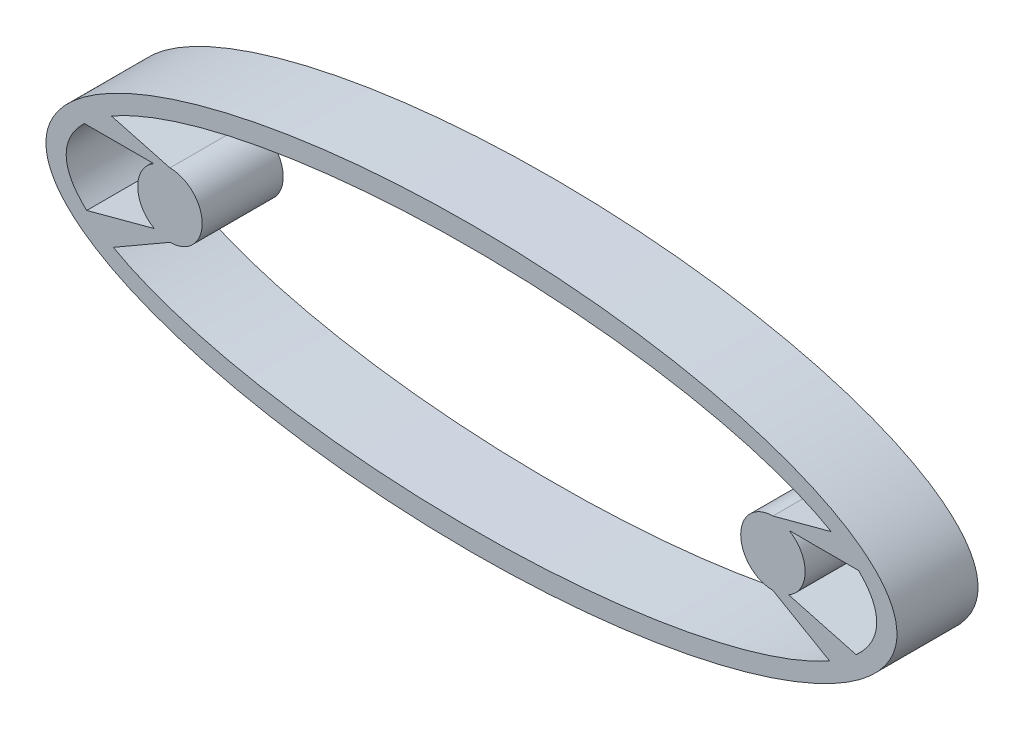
ISO-10303-21;
HEADER;
FILE_DESCRIPTION(('STEP AP214'),'2;1');
FILE_NAME('part.step','',(''),(''),'','','');
FILE_SCHEMA(('AUTOMOTIVE_DESIGN { 1 0 10303 214 1 1 1 1 }'));
ENDSEC;
DATA;
#1=APPLICATION_CONTEXT('core data for automotive mechanical design processes');
#2=APPLICATION_PROTOCOL_DEFINITION('international standard','automotive_design',2000,#1);
#3=PRODUCT_CONTEXT('',#1,'mechanical');
#4=PRODUCT('Part','Part','',(#3));
#5=PRODUCT_RELATED_PRODUCT_CATEGORY('part','',(#4));
#6=PRODUCT_DEFINITION_FORMATION('','',#4);
#7=PRODUCT_DEFINITION_CONTEXT('part definition',#1,'design');
#8=PRODUCT_DEFINITION('design','',#6,#7);
#9=PRODUCT_DEFINITION_SHAPE('','',#8);
#10=(LENGTH_UNIT() NAMED_UNIT(*) SI_UNIT(.MILLI.,.METRE.));
#11=(NAMED_UNIT(*) PLANE_ANGLE_UNIT() SI_UNIT($,.RADIAN.));
#12=(NAMED_UNIT(*) SI_UNIT($,.STERADIAN.) SOLID_ANGLE_UNIT());
#13=UNCERTAINTY_MEASURE_WITH_UNIT(LENGTH_MEASURE(1.E-05),#10,'distance_accuracy_value','');
#14=(GEOMETRIC_REPRESENTATION_CONTEXT(3) GLOBAL_UNCERTAINTY_ASSIGNED_CONTEXT((#13)) GLOBAL_UNIT_ASSIGNED_CONTEXT((#10,
#11,#12)) REPRESENTATION_CONTEXT('',''));
#15=CARTESIAN_POINT('',(0.,0.,0.));
#16=DIRECTION('',(0.,0.,1.));
#17=DIRECTION('',(1.,0.,0.));
#18=AXIS2_PLACEMENT_3D('',#15,#16,#17);
#19=CARTESIAN_POINT('',(0.,0.,10.));
#20=DIRECTION('',(0.,0.,1.));
#21=DIRECTION('',(1.,0.,0.));
#22=AXIS2_PLACEMENT_3D('',#19,#20,#21);
#23=PLANE('',#22);
#24=CARTESIAN_POINT('',(0.,0.,10.));
#25=DIRECTION('',(0.,0.,-1.));
#26=DIRECTION('',(-1.,0.,0.));
#27=AXIS2_PLACEMENT_3D('',#24,#25,#26);
#28=ELLIPSE('',#27,50.,15.);
#29=CARTESIAN_POINT('',(47.7741547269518,4.42568781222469,10.));
#30=VERTEX_POINT('',#29);
#31=CARTESIAN_POINT('',(47.4641903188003,-4.716307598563,10.));
#32=VERTEX_POINT('',#31);
#33=EDGE_CURVE('E328',#30,#32,#28,.T.);
#34=ORIENTED_EDGE('',*,*,#33,.T.);
#35=DIRECTION('',(-0.96592582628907,0.258819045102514,0.));
#36=VECTOR('',#35,1.);
#37=CARTESIAN_POINT('',(2.00042096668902,7.46567268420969,10.));
#38=LINE('',#37,#36);
#39=CARTESIAN_POINT('',(39.1336919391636,-2.48415728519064,10.));
#40=VERTEX_POINT('',#39);
#41=EDGE_CURVE('E340',#32,#40,#38,.T.);
#42=ORIENTED_EDGE('',*,*,#41,.T.);
#43=CARTESIAN_POINT('',(37.1979748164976,0.989072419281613,10.));
#44=DIRECTION('',(0.,0.,1.));
#45=DIRECTION('',(1.,0.,0.));
#46=AXIS2_PLACEMENT_3D('',#43,#44,#45);
#47=CIRCLE('',#46,3.97621998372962);
#48=CARTESIAN_POINT('',(39.197974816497,4.42568781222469,10.));
#49=VERTEX_POINT('',#48);
#50=EDGE_CURVE('E337',#49,#40,#47,.F.);
#51=ORIENTED_EDGE('',*,*,#50,.F.);
#52=DIRECTION('',(1.,0.,0.));
#53=VECTOR('',#52,1.);
#54=CARTESIAN_POINT('',(0.,4.4256878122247,10.));
#55=LINE('',#54,#53);
#56=EDGE_CURVE('E332',#49,#30,#55,.T.);
#57=ORIENTED_EDGE('',*,*,#56,.T.);
#58=EDGE_LOOP('',(#34,#42,#51,#57));
#59=FACE_BOUND('',#58,.T.);
#60=CARTESIAN_POINT('',(0.,0.,10.));
#61=DIRECTION('',(0.,0.,1.));
#62=DIRECTION('',(1.,0.,0.));
#63=AXIS2_PLACEMENT_3D('',#60,#61,#62);
#64=ELLIPSE('',#63,52.5,17.5);
#65=CARTESIAN_POINT('',(52.5,0.,10.));
#66=VERTEX_POINT('',#65);
#67=EDGE_CURVE('E12',#66,#66,#64,.T.);
#68=ORIENTED_EDGE('',*,*,#67,.T.);
#69=EDGE_LOOP('',(#68));
#70=FACE_BOUND('',#69,.T.);
#71=CARTESIAN_POINT('',(0.,0.,10.));
#72=DIRECTION('',(0.,0.,1.));
#73=DIRECTION('',(1.,0.,0.));
#74=AXIS2_PLACEMENT_3D('',#71,#72,#73);
#75=ELLIPSE('',#74,50.,15.);
#76=CARTESIAN_POINT('',(44.4030477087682,6.8958858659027,10.));
#77=VERTEX_POINT('',#76);
#78=CARTESIAN_POINT('',(-44.4030477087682,6.8958858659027,10.));
#79=VERTEX_POINT('',#78);
#80=EDGE_CURVE('E364',#77,#79,#75,.T.);
#81=ORIENTED_EDGE('',*,*,#80,.F.);
#82=DIRECTION('',(0.965925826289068,0.258819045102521,0.));
#83=VECTOR('',#82,1.);
#84=CARTESIAN_POINT('',(1.2504687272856,-4.66681282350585,10.));
#85=LINE('',#84,#83);
#86=CARTESIAN_POINT('',(37.197974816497,4.96529240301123,10.));
#87=VERTEX_POINT('',#86);
#88=EDGE_CURVE('E362',#87,#77,#85,.T.);
#89=ORIENTED_EDGE('',*,*,#88,.F.);
#90=CARTESIAN_POINT('',(37.1979748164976,0.989072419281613,10.));
#91=DIRECTION('',(0.,0.,1.));
#92=DIRECTION('',(1.,0.,0.));
#93=AXIS2_PLACEMENT_3D('',#90,#91,#92);
#94=CIRCLE('',#93,3.97621998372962);
#95=CARTESIAN_POINT('',(37.1979748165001,-2.987147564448,10.));
#96=VERTEX_POINT('',#95);
#97=EDGE_CURVE('E594',#96,#87,#94,.F.);
#98=ORIENTED_EDGE('',*,*,#97,.F.);
#99=DIRECTION('',(0.866025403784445,-0.499999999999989,0.));
#100=VECTOR('',#99,1.);
#101=CARTESIAN_POINT('',(8.00602086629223,13.8668349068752,10.));
#102=LINE('',#101,#100);
#103=CARTESIAN_POINT('',(44.184735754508,-7.02095587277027,10.));
#104=VERTEX_POINT('',#103);
#105=EDGE_CURVE('E622',#96,#104,#102,.T.);
#106=ORIENTED_EDGE('',*,*,#105,.T.);
#107=CARTESIAN_POINT('',(0.,0.,10.));
#108=DIRECTION('',(0.,0.,1.));
#109=DIRECTION('',(1.,0.,0.));
#110=AXIS2_PLACEMENT_3D('',#107,#108,#109);
#111=ELLIPSE('',#110,50.,15.);
#112=CARTESIAN_POINT('',(-44.1847357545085,-7.02095587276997,10.));
#113=VERTEX_POINT('',#112);
#114=EDGE_CURVE('E617',#113,#104,#111,.T.);
#115=ORIENTED_EDGE('',*,*,#114,.F.);
#116=DIRECTION('',(-0.866025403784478,-0.499999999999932,0.));
#117=VECTOR('',#116,1.);
#118=CARTESIAN_POINT('',(-8.00602086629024,13.8668349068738,10.));
#119=LINE('',#118,#117);
#120=CARTESIAN_POINT('',(-37.1979748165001,-2.987147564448,10.));
#121=VERTEX_POINT('',#120);
#122=EDGE_CURVE('E616',#121,#113,#119,.T.);
#123=ORIENTED_EDGE('',*,*,#122,.F.);
#124=CARTESIAN_POINT('',(-37.1979748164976,0.989072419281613,10.));
#125=DIRECTION('',(0.,0.,1.));
#126=DIRECTION('',(1.,0.,0.));
#127=AXIS2_PLACEMENT_3D('',#124,#125,#126);
#128=CIRCLE('',#127,3.97621998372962);
#129=CARTESIAN_POINT('',(-37.197974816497,4.96529240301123,10.));
#130=VERTEX_POINT('',#129);
#131=EDGE_CURVE('E615',#121,#130,#128,.T.);
#132=ORIENTED_EDGE('',*,*,#131,.T.);
#133=DIRECTION('',(-0.965925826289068,0.258819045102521,0.));
#134=VECTOR('',#133,1.);
#135=CARTESIAN_POINT('',(-1.2504687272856,-4.66681282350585,10.));
#136=LINE('',#135,#134);
#137=EDGE_CURVE('E368',#130,#79,#136,.T.);
#138=ORIENTED_EDGE('',*,*,#137,.T.);
#139=EDGE_LOOP('',(#81,#89,#98,#106,#115,#123,#132,#138));
#140=FACE_BOUND('',#139,.T.);
#141=CARTESIAN_POINT('',(0.,0.,10.));
#142=DIRECTION('',(0.,0.,1.));
#143=DIRECTION('',(1.,0.,0.));
#144=AXIS2_PLACEMENT_3D('',#141,#142,#143);
#145=ELLIPSE('',#144,50.,15.);
#146=CARTESIAN_POINT('',(-47.7741547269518,4.42568781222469,10.));
#147=VERTEX_POINT('',#146);
#148=CARTESIAN_POINT('',(-47.4641903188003,-4.716307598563,10.));
#149=VERTEX_POINT('',#148);
#150=EDGE_CURVE('E283',#147,#149,#145,.T.);
#151=ORIENTED_EDGE('',*,*,#150,.F.);
#152=DIRECTION('',(-1.,0.,0.));
#153=VECTOR('',#152,1.);
#154=CARTESIAN_POINT('',(0.,4.4256878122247,10.));
#155=LINE('',#154,#153);
#156=CARTESIAN_POINT('',(-39.197974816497,4.42568781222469,10.));
#157=VERTEX_POINT('',#156);
#158=EDGE_CURVE('E275',#157,#147,#155,.T.);
#159=ORIENTED_EDGE('',*,*,#158,.F.);
#160=CARTESIAN_POINT('',(-37.1979748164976,0.989072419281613,10.));
#161=DIRECTION('',(0.,0.,1.));
#162=DIRECTION('',(1.,0.,0.));
#163=AXIS2_PLACEMENT_3D('',#160,#161,#162);
#164=CIRCLE('',#163,3.97621998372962);
#165=CARTESIAN_POINT('',(-39.1336919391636,-2.48415728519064,10.));
#166=VERTEX_POINT('',#165);
#167=EDGE_CURVE('E297',#157,#166,#164,.T.);
#168=ORIENTED_EDGE('',*,*,#167,.T.);
#169=DIRECTION('',(0.96592582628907,0.258819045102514,0.));
#170=VECTOR('',#169,1.);
#171=CARTESIAN_POINT('',(-2.00042096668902,7.46567268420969,10.));
#172=LINE('',#171,#170);
#173=EDGE_CURVE('E295',#149,#166,#172,.T.);
#174=ORIENTED_EDGE('',*,*,#173,.F.);
#175=EDGE_LOOP('',(#151,#159,#168,#174));
#176=FACE_BOUND('',#175,.T.);
#177=ADVANCED_FACE('F162',(#59,#70,#140,#176),#23,.T.);
#178=CARTESIAN_POINT('',(0.,0.,0.));
#179=DIRECTION('',(0.,0.,1.));
#180=DIRECTION('',(1.,0.,0.));
#181=AXIS2_PLACEMENT_3D('',#178,#179,#180);
#182=PLANE('',#181);
#183=DIRECTION('',(0.965925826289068,0.258819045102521,0.));
#184=VECTOR('',#183,1.);
#185=CARTESIAN_POINT('',(1.2504687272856,-4.66681282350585,0.));
#186=LINE('',#185,#184);
#187=CARTESIAN_POINT('',(37.197974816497,4.96529240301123,0.));
#188=VERTEX_POINT('',#187);
#189=CARTESIAN_POINT('',(44.4030477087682,6.8958858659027,0.));
#190=VERTEX_POINT('',#189);
#191=EDGE_CURVE('E361',#188,#190,#186,.T.);
#192=ORIENTED_EDGE('',*,*,#191,.T.);
#193=CARTESIAN_POINT('',(0.,0.,0.));
#194=DIRECTION('',(0.,0.,1.));
#195=DIRECTION('',(1.,0.,0.));
#196=AXIS2_PLACEMENT_3D('',#193,#194,#195);
#197=ELLIPSE('',#196,50.,15.);
#198=CARTESIAN_POINT('',(-44.4030477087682,6.8958858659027,0.));
#199=VERTEX_POINT('',#198);
#200=EDGE_CURVE('E571',#190,#199,#197,.T.);
#201=ORIENTED_EDGE('',*,*,#200,.T.);
#202=DIRECTION('',(-0.965925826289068,0.258819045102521,0.));
#203=VECTOR('',#202,1.);
#204=CARTESIAN_POINT('',(-1.2504687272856,-4.66681282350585,0.));
#205=LINE('',#204,#203);
#206=CARTESIAN_POINT('',(-37.197974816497,4.96529240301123,0.));
#207=VERTEX_POINT('',#206);
#208=EDGE_CURVE('E563',#207,#199,#205,.T.);
#209=ORIENTED_EDGE('',*,*,#208,.F.);
#210=CARTESIAN_POINT('',(-37.1979748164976,0.989072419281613,0.));
#211=DIRECTION('',(0.,0.,1.));
#212=DIRECTION('',(1.,0.,0.));
#213=AXIS2_PLACEMENT_3D('',#210,#211,#212);
#214=CIRCLE('',#213,3.97621998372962);
#215=CARTESIAN_POINT('',(-37.1979748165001,-2.987147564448,0.));
#216=VERTEX_POINT('',#215);
#217=EDGE_CURVE('E570',#216,#207,#214,.T.);
#218=ORIENTED_EDGE('',*,*,#217,.F.);
#219=DIRECTION('',(-0.866025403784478,-0.499999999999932,0.));
#220=VECTOR('',#219,1.);
#221=CARTESIAN_POINT('',(-8.00602086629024,13.8668349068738,0.));
#222=LINE('',#221,#220);
#223=CARTESIAN_POINT('',(-44.1847357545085,-7.02095587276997,0.));
#224=VERTEX_POINT('',#223);
#225=EDGE_CURVE('E580',#216,#224,#222,.T.);
#226=ORIENTED_EDGE('',*,*,#225,.T.);
#227=CARTESIAN_POINT('',(0.,0.,0.));
#228=DIRECTION('',(0.,0.,1.));
#229=DIRECTION('',(1.,0.,0.));
#230=AXIS2_PLACEMENT_3D('',#227,#228,#229);
#231=ELLIPSE('',#230,50.,15.);
#232=CARTESIAN_POINT('',(44.184735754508,-7.02095587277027,0.));
#233=VERTEX_POINT('',#232);
#234=EDGE_CURVE('E583',#224,#233,#231,.T.);
#235=ORIENTED_EDGE('',*,*,#234,.T.);
#236=DIRECTION('',(0.866025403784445,-0.499999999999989,0.));
#237=VECTOR('',#236,1.);
#238=CARTESIAN_POINT('',(8.00602086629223,13.8668349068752,0.));
#239=LINE('',#238,#237);
#240=CARTESIAN_POINT('',(37.1979748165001,-2.987147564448,0.));
#241=VERTEX_POINT('',#240);
#242=EDGE_CURVE('E586',#241,#233,#239,.T.);
#243=ORIENTED_EDGE('',*,*,#242,.F.);
#244=CARTESIAN_POINT('',(37.1979748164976,0.989072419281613,0.));
#245=DIRECTION('',(0.,0.,1.));
#246=DIRECTION('',(1.,0.,0.));
#247=AXIS2_PLACEMENT_3D('',#244,#245,#246);
#248=CIRCLE('',#247,3.97621998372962);
#249=EDGE_CURVE('E365',#241,#188,#248,.F.);
#250=ORIENTED_EDGE('',*,*,#249,.T.);
#251=EDGE_LOOP('',(#192,#201,#209,#218,#226,#235,#243,#250));
#252=FACE_BOUND('',#251,.T.);
#253=CARTESIAN_POINT('',(0.,0.,0.));
#254=DIRECTION('',(0.,0.,1.));
#255=DIRECTION('',(1.,0.,0.));
#256=AXIS2_PLACEMENT_3D('',#253,#254,#255);
#257=ELLIPSE('',#256,52.5,17.5);
#258=CARTESIAN_POINT('',(52.5,0.,0.));
#259=VERTEX_POINT('',#258);
#260=EDGE_CURVE('E167',#259,#259,#257,.T.);
#261=ORIENTED_EDGE('',*,*,#260,.F.);
#262=EDGE_LOOP('',(#261));
#263=FACE_BOUND('',#262,.T.);
#264=DIRECTION('',(-0.96592582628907,0.258819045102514,0.));
#265=VECTOR('',#264,1.);
#266=CARTESIAN_POINT('',(2.00042096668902,7.46567268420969,0.));
#267=LINE('',#266,#265);
#268=CARTESIAN_POINT('',(47.4641903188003,-4.716307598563,0.));
#269=VERTEX_POINT('',#268);
#270=CARTESIAN_POINT('',(39.1336919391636,-2.48415728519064,0.));
#271=VERTEX_POINT('',#270);
#272=EDGE_CURVE('E333',#269,#271,#267,.T.);
#273=ORIENTED_EDGE('',*,*,#272,.F.);
#274=CARTESIAN_POINT('',(0.,0.,0.));
#275=DIRECTION('',(0.,0.,-1.));
#276=DIRECTION('',(-1.,0.,0.));
#277=AXIS2_PLACEMENT_3D('',#274,#275,#276);
#278=ELLIPSE('',#277,50.,15.);
#279=CARTESIAN_POINT('',(47.7741547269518,4.42568781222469,0.));
#280=VERTEX_POINT('',#279);
#281=EDGE_CURVE('E291',#280,#269,#278,.T.);
#282=ORIENTED_EDGE('',*,*,#281,.F.);
#283=DIRECTION('',(1.,0.,0.));
#284=VECTOR('',#283,1.);
#285=CARTESIAN_POINT('',(0.,4.4256878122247,0.));
#286=LINE('',#285,#284);
#287=CARTESIAN_POINT('',(39.197974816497,4.42568781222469,0.));
#288=VERTEX_POINT('',#287);
#289=EDGE_CURVE('E345',#288,#280,#286,.T.);
#290=ORIENTED_EDGE('',*,*,#289,.F.);
#291=CARTESIAN_POINT('',(37.1979748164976,0.989072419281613,0.));
#292=DIRECTION('',(0.,0.,1.));
#293=DIRECTION('',(1.,0.,0.));
#294=AXIS2_PLACEMENT_3D('',#291,#292,#293);
#295=CIRCLE('',#294,3.97621998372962);
#296=EDGE_CURVE('E348',#288,#271,#295,.F.);
#297=ORIENTED_EDGE('',*,*,#296,.T.);
#298=EDGE_LOOP('',(#273,#282,#290,#297));
#299=FACE_BOUND('',#298,.T.);
#300=DIRECTION('',(-1.,0.,0.));
#301=VECTOR('',#300,1.);
#302=CARTESIAN_POINT('',(0.,4.4256878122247,0.));
#303=LINE('',#302,#301);
#304=CARTESIAN_POINT('',(-39.197974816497,4.42568781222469,0.));
#305=VERTEX_POINT('',#304);
#306=CARTESIAN_POINT('',(-47.7741547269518,4.42568781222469,0.));
#307=VERTEX_POINT('',#306);
#308=EDGE_CURVE('E185',#305,#307,#303,.T.);
#309=ORIENTED_EDGE('',*,*,#308,.T.);
#310=CARTESIAN_POINT('',(0.,0.,0.));
#311=DIRECTION('',(0.,0.,1.));
#312=DIRECTION('',(1.,0.,0.));
#313=AXIS2_PLACEMENT_3D('',#310,#311,#312);
#314=ELLIPSE('',#313,50.,15.);
#315=CARTESIAN_POINT('',(-47.4641903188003,-4.716307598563,0.));
#316=VERTEX_POINT('',#315);
#317=EDGE_CURVE('E290',#307,#316,#314,.T.);
#318=ORIENTED_EDGE('',*,*,#317,.T.);
#319=DIRECTION('',(0.96592582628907,0.258819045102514,0.));
#320=VECTOR('',#319,1.);
#321=CARTESIAN_POINT('',(-2.00042096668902,7.46567268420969,0.));
#322=LINE('',#321,#320);
#323=CARTESIAN_POINT('',(-39.1336919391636,-2.48415728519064,0.));
#324=VERTEX_POINT('',#323);
#325=EDGE_CURVE('E404',#316,#324,#322,.T.);
#326=ORIENTED_EDGE('',*,*,#325,.T.);
#327=CARTESIAN_POINT('',(-37.1979748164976,0.989072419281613,0.));
#328=DIRECTION('',(0.,0.,1.));
#329=DIRECTION('',(1.,0.,0.));
#330=AXIS2_PLACEMENT_3D('',#327,#328,#329);
#331=CIRCLE('',#330,3.97621998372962);
#332=EDGE_CURVE('E284',#305,#324,#331,.T.);
#333=ORIENTED_EDGE('',*,*,#332,.F.);
#334=EDGE_LOOP('',(#309,#318,#326,#333));
#335=FACE_BOUND('',#334,.T.);
#336=ADVANCED_FACE('F383',(#252,#263,#299,#335),#182,.F.);
#337=DIRECTION('',(0.,0.,-1.));
#338=VECTOR('',#337,1.);
#339=SURFACE_OF_LINEAR_EXTRUSION('',#64,#338);
#340=ORIENTED_EDGE('',*,*,#67,.F.);
#341=EDGE_LOOP('',(#340));
#342=FACE_BOUND('',#341,.T.);
#343=ORIENTED_EDGE('',*,*,#260,.T.);
#344=EDGE_LOOP('',(#343));
#345=FACE_BOUND('',#344,.T.);
#346=ADVANCED_FACE('F164',(#342,#345),#339,.F.);
#347=CARTESIAN_POINT('',(1.2504687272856,-4.66681282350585,10.));
#348=DIRECTION('',(-0.258819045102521,0.965925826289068,0.));
#349=DIRECTION('',(-0.965925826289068,-0.258819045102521,0.));
#350=AXIS2_PLACEMENT_3D('',#347,#348,#349);
#351=PLANE('',#350);
#352=ORIENTED_EDGE('',*,*,#191,.F.);
#353=DIRECTION('',(0.,0.,-1.));
#354=VECTOR('',#353,1.);
#355=CARTESIAN_POINT('',(37.197974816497,4.96529240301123,10.));
#356=LINE('',#355,#354);
#357=EDGE_CURVE('E590',#87,#188,#356,.T.);
#358=ORIENTED_EDGE('',*,*,#357,.F.);
#359=ORIENTED_EDGE('',*,*,#88,.T.);
#360=DIRECTION('',(0.,0.,-1.));
#361=VECTOR('',#360,1.);
#362=CARTESIAN_POINT('',(44.4030477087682,6.8958858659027,10.));
#363=LINE('',#362,#361);
#364=EDGE_CURVE('E604',#77,#190,#363,.T.);
#365=ORIENTED_EDGE('',*,*,#364,.T.);
#366=EDGE_LOOP('',(#352,#358,#359,#365));
#367=FACE_BOUND('',#366,.T.);
#368=ADVANCED_FACE('F376',(#367),#351,.T.);
#369=DIRECTION('',(0.,0.,-1.));
#370=VECTOR('',#369,1.);
#371=SURFACE_OF_LINEAR_EXTRUSION('',#75,#370);
#372=ORIENTED_EDGE('',*,*,#200,.F.);
#373=ORIENTED_EDGE('',*,*,#364,.F.);
#374=ORIENTED_EDGE('',*,*,#80,.T.);
#375=DIRECTION('',(0.,0.,-1.));
#376=VECTOR('',#375,1.);
#377=CARTESIAN_POINT('',(-44.4030477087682,6.8958858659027,10.));
#378=LINE('',#377,#376);
#379=EDGE_CURVE('E565',#79,#199,#378,.T.);
#380=ORIENTED_EDGE('',*,*,#379,.T.);
#381=EDGE_LOOP('',(#372,#373,#374,#380));
#382=FACE_BOUND('',#381,.T.);
#383=ADVANCED_FACE('F371',(#382),#371,.T.);
#384=CARTESIAN_POINT('',(-1.2504687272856,-4.66681282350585,10.));
#385=DIRECTION('',(-0.258819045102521,-0.965925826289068,0.));
#386=DIRECTION('',(0.965925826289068,-0.258819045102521,0.));
#387=AXIS2_PLACEMENT_3D('',#384,#385,#386);
#388=PLANE('',#387);
#389=ORIENTED_EDGE('',*,*,#208,.T.);
#390=ORIENTED_EDGE('',*,*,#379,.F.);
#391=ORIENTED_EDGE('',*,*,#137,.F.);
#392=DIRECTION('',(0.,0.,-1.));
#393=VECTOR('',#392,1.);
#394=CARTESIAN_POINT('',(-37.197974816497,4.96529240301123,10.));
#395=LINE('',#394,#393);
#396=EDGE_CURVE('E567',#130,#207,#395,.T.);
#397=ORIENTED_EDGE('',*,*,#396,.T.);
#398=EDGE_LOOP('',(#389,#390,#391,#397));
#399=FACE_BOUND('',#398,.T.);
#400=ADVANCED_FACE('F375',(#399),#388,.F.);
#401=CARTESIAN_POINT('',(-37.1979748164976,0.989072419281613,10.));
#402=DIRECTION('',(0.,0.,-1.));
#403=DIRECTION('',(-1.,0.,0.));
#404=AXIS2_PLACEMENT_3D('',#401,#402,#403);
#405=CYLINDRICAL_SURFACE('',#404,3.97621998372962);
#406=ORIENTED_EDGE('',*,*,#217,.T.);
#407=ORIENTED_EDGE('',*,*,#396,.F.);
#408=ORIENTED_EDGE('',*,*,#131,.F.);
#409=DIRECTION('',(0.,0.,-1.));
#410=VECTOR('',#409,1.);
#411=CARTESIAN_POINT('',(-37.1979748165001,-2.987147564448,10.));
#412=LINE('',#411,#410);
#413=EDGE_CURVE('E600',#121,#216,#412,.T.);
#414=ORIENTED_EDGE('',*,*,#413,.T.);
#415=EDGE_LOOP('',(#406,#407,#408,#414));
#416=FACE_BOUND('',#415,.T.);
#417=ADVANCED_FACE('F471',(#416),#405,.T.);
#418=CARTESIAN_POINT('',(-8.00602086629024,13.8668349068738,10.));
#419=DIRECTION('',(0.499999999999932,-0.866025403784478,0.));
#420=DIRECTION('',(0.866025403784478,0.499999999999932,0.));
#421=AXIS2_PLACEMENT_3D('',#418,#419,#420);
#422=PLANE('',#421);
#423=ORIENTED_EDGE('',*,*,#225,.F.);
#424=ORIENTED_EDGE('',*,*,#413,.F.);
#425=ORIENTED_EDGE('',*,*,#122,.T.);
#426=DIRECTION('',(0.,0.,-1.));
#427=VECTOR('',#426,1.);
#428=CARTESIAN_POINT('',(-44.1847357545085,-7.02095587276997,10.));
#429=LINE('',#428,#427);
#430=EDGE_CURVE('E598',#113,#224,#429,.T.);
#431=ORIENTED_EDGE('',*,*,#430,.T.);
#432=EDGE_LOOP('',(#423,#424,#425,#431));
#433=FACE_BOUND('',#432,.T.);
#434=ADVANCED_FACE('F463',(#433),#422,.T.);
#435=DIRECTION('',(0.,0.,-1.));
#436=VECTOR('',#435,1.);
#437=SURFACE_OF_LINEAR_EXTRUSION('',#111,#436);
#438=ORIENTED_EDGE('',*,*,#234,.F.);
#439=ORIENTED_EDGE('',*,*,#430,.F.);
#440=ORIENTED_EDGE('',*,*,#114,.T.);
#441=DIRECTION('',(0.,0.,-1.));
#442=VECTOR('',#441,1.);
#443=CARTESIAN_POINT('',(44.184735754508,-7.02095587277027,10.));
#444=LINE('',#443,#442);
#445=EDGE_CURVE('E596',#104,#233,#444,.T.);
#446=ORIENTED_EDGE('',*,*,#445,.T.);
#447=EDGE_LOOP('',(#438,#439,#440,#446));
#448=FACE_BOUND('',#447,.T.);
#449=ADVANCED_FACE('F456',(#448),#437,.T.);
#450=CARTESIAN_POINT('',(8.00602086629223,13.8668349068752,10.));
#451=DIRECTION('',(0.499999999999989,0.866025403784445,0.));
#452=DIRECTION('',(-0.866025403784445,0.499999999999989,0.));
#453=AXIS2_PLACEMENT_3D('',#450,#451,#452);
#454=PLANE('',#453);
#455=ORIENTED_EDGE('',*,*,#242,.T.);
#456=ORIENTED_EDGE('',*,*,#445,.F.);
#457=ORIENTED_EDGE('',*,*,#105,.F.);
#458=DIRECTION('',(0.,0.,-1.));
#459=VECTOR('',#458,1.);
#460=CARTESIAN_POINT('',(37.1979748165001,-2.987147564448,10.));
#461=LINE('',#460,#459);
#462=EDGE_CURVE('E593',#96,#241,#461,.T.);
#463=ORIENTED_EDGE('',*,*,#462,.T.);
#464=EDGE_LOOP('',(#455,#456,#457,#463));
#465=FACE_BOUND('',#464,.T.);
#466=ADVANCED_FACE('F449',(#465),#454,.F.);
#467=CARTESIAN_POINT('',(37.1979748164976,0.989072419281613,10.));
#468=DIRECTION('',(0.,0.,-1.));
#469=DIRECTION('',(-1.,0.,0.));
#470=AXIS2_PLACEMENT_3D('',#467,#468,#469);
#471=CYLINDRICAL_SURFACE('',#470,3.97621998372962);
#472=ORIENTED_EDGE('',*,*,#249,.F.);
#473=ORIENTED_EDGE('',*,*,#462,.F.);
#474=ORIENTED_EDGE('',*,*,#97,.T.);
#475=ORIENTED_EDGE('',*,*,#357,.T.);
#476=EDGE_LOOP('',(#472,#473,#474,#475));
#477=FACE_BOUND('',#476,.T.);
#478=ADVANCED_FACE('F325',(#477),#471,.T.);
#479=DIRECTION('',(0.,0.,-1.));
#480=VECTOR('',#479,1.);
#481=SURFACE_OF_LINEAR_EXTRUSION('',#28,#480);
#482=ORIENTED_EDGE('',*,*,#281,.T.);
#483=DIRECTION('',(0.,0.,-1.));
#484=VECTOR('',#483,1.);
#485=CARTESIAN_POINT('',(47.4641903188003,-4.716307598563,10.));
#486=LINE('',#485,#484);
#487=EDGE_CURVE('E343',#32,#269,#486,.T.);
#488=ORIENTED_EDGE('',*,*,#487,.F.);
#489=ORIENTED_EDGE('',*,*,#33,.F.);
#490=DIRECTION('',(0.,0.,-1.));
#491=VECTOR('',#490,1.);
#492=CARTESIAN_POINT('',(47.7741547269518,4.42568781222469,10.));
#493=LINE('',#492,#491);
#494=EDGE_CURVE('E359',#30,#280,#493,.T.);
#495=ORIENTED_EDGE('',*,*,#494,.T.);
#496=EDGE_LOOP('',(#482,#488,#489,#495));
#497=FACE_BOUND('',#496,.T.);
#498=ADVANCED_FACE('F320',(#497),#481,.F.);
#499=CARTESIAN_POINT('',(0.,4.4256878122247,10.));
#500=DIRECTION('',(0.,1.,0.));
#501=DIRECTION('',(-1.,0.,0.));
#502=AXIS2_PLACEMENT_3D('',#499,#500,#501);
#503=PLANE('',#502);
#504=ORIENTED_EDGE('',*,*,#289,.T.);
#505=ORIENTED_EDGE('',*,*,#494,.F.);
#506=ORIENTED_EDGE('',*,*,#56,.F.);
#507=DIRECTION('',(0.,0.,-1.));
#508=VECTOR('',#507,1.);
#509=CARTESIAN_POINT('',(39.197974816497,4.42568781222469,10.));
#510=LINE('',#509,#508);
#511=EDGE_CURVE('E357',#49,#288,#510,.T.);
#512=ORIENTED_EDGE('',*,*,#511,.T.);
#513=EDGE_LOOP('',(#504,#505,#506,#512));
#514=FACE_BOUND('',#513,.T.);
#515=ADVANCED_FACE('F316',(#514),#503,.F.);
#516=CARTESIAN_POINT('',(37.1979748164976,0.989072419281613,10.));
#517=DIRECTION('',(0.,0.,-1.));
#518=DIRECTION('',(-1.,0.,0.));
#519=AXIS2_PLACEMENT_3D('',#516,#517,#518);
#520=CYLINDRICAL_SURFACE('',#519,3.97621998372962);
#521=ORIENTED_EDGE('',*,*,#296,.F.);
#522=ORIENTED_EDGE('',*,*,#511,.F.);
#523=ORIENTED_EDGE('',*,*,#50,.T.);
#524=DIRECTION('',(0.,0.,-1.));
#525=VECTOR('',#524,1.);
#526=CARTESIAN_POINT('',(39.1336919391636,-2.48415728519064,10.));
#527=LINE('',#526,#525);
#528=EDGE_CURVE('E355',#40,#271,#527,.T.);
#529=ORIENTED_EDGE('',*,*,#528,.T.);
#530=EDGE_LOOP('',(#521,#522,#523,#529));
#531=FACE_BOUND('',#530,.T.);
#532=ADVANCED_FACE('F312',(#531),#520,.T.);
#533=CARTESIAN_POINT('',(2.00042096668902,7.46567268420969,10.));
#534=DIRECTION('',(-0.258819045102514,-0.96592582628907,0.));
#535=DIRECTION('',(0.96592582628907,-0.258819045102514,0.));
#536=AXIS2_PLACEMENT_3D('',#533,#534,#535);
#537=PLANE('',#536);
#538=ORIENTED_EDGE('',*,*,#272,.T.);
#539=ORIENTED_EDGE('',*,*,#528,.F.);
#540=ORIENTED_EDGE('',*,*,#41,.F.);
#541=ORIENTED_EDGE('',*,*,#487,.T.);
#542=EDGE_LOOP('',(#538,#539,#540,#541));
#543=FACE_BOUND('',#542,.T.);
#544=ADVANCED_FACE('F309',(#543),#537,.F.);
#545=CARTESIAN_POINT('',(0.,4.4256878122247,10.));
#546=DIRECTION('',(0.,-1.,0.));
#547=DIRECTION('',(1.,0.,0.));
#548=AXIS2_PLACEMENT_3D('',#545,#546,#547);
#549=PLANE('',#548);
#550=ORIENTED_EDGE('',*,*,#308,.F.);
#551=DIRECTION('',(0.,0.,-1.));
#552=VECTOR('',#551,1.);
#553=CARTESIAN_POINT('',(-39.197974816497,4.42568781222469,10.));
#554=LINE('',#553,#552);
#555=EDGE_CURVE('E279',#157,#305,#554,.T.);
#556=ORIENTED_EDGE('',*,*,#555,.F.);
#557=ORIENTED_EDGE('',*,*,#158,.T.);
#558=DIRECTION('',(0.,0.,-1.));
#559=VECTOR('',#558,1.);
#560=CARTESIAN_POINT('',(-47.7741547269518,4.42568781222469,10.));
#561=LINE('',#560,#559);
#562=EDGE_CURVE('E278',#147,#307,#561,.T.);
#563=ORIENTED_EDGE('',*,*,#562,.T.);
#564=EDGE_LOOP('',(#550,#556,#557,#563));
#565=FACE_BOUND('',#564,.T.);
#566=ADVANCED_FACE('F277',(#565),#549,.T.);
#567=DIRECTION('',(0.,0.,-1.));
#568=VECTOR('',#567,1.);
#569=SURFACE_OF_LINEAR_EXTRUSION('',#145,#568);
#570=ORIENTED_EDGE('',*,*,#317,.F.);
#571=ORIENTED_EDGE('',*,*,#562,.F.);
#572=ORIENTED_EDGE('',*,*,#150,.T.);
#573=DIRECTION('',(0.,0.,-1.));
#574=VECTOR('',#573,1.);
#575=CARTESIAN_POINT('',(-47.4641903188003,-4.716307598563,10.));
#576=LINE('',#575,#574);
#577=EDGE_CURVE('E292',#149,#316,#576,.T.);
#578=ORIENTED_EDGE('',*,*,#577,.T.);
#579=EDGE_LOOP('',(#570,#571,#572,#578));
#580=FACE_BOUND('',#579,.T.);
#581=ADVANCED_FACE('F287',(#580),#569,.T.);
#582=CARTESIAN_POINT('',(-2.00042096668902,7.46567268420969,10.));
#583=DIRECTION('',(-0.258819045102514,0.96592582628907,0.));
#584=DIRECTION('',(-0.96592582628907,-0.258819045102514,0.));
#585=AXIS2_PLACEMENT_3D('',#582,#583,#584);
#586=PLANE('',#585);
#587=ORIENTED_EDGE('',*,*,#325,.F.);
#588=ORIENTED_EDGE('',*,*,#577,.F.);
#589=ORIENTED_EDGE('',*,*,#173,.T.);
#590=DIRECTION('',(0.,0.,-1.));
#591=VECTOR('',#590,1.);
#592=CARTESIAN_POINT('',(-39.1336919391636,-2.48415728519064,10.));
#593=LINE('',#592,#591);
#594=EDGE_CURVE('E177',#166,#324,#593,.T.);
#595=ORIENTED_EDGE('',*,*,#594,.T.);
#596=EDGE_LOOP('',(#587,#588,#589,#595));
#597=FACE_BOUND('',#596,.T.);
#598=ADVANCED_FACE('F305',(#597),#586,.T.);
#599=CARTESIAN_POINT('',(-37.1979748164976,0.989072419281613,10.));
#600=DIRECTION('',(0.,0.,-1.));
#601=DIRECTION('',(-1.,0.,0.));
#602=AXIS2_PLACEMENT_3D('',#599,#600,#601);
#603=CYLINDRICAL_SURFACE('',#602,3.97621998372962);
#604=ORIENTED_EDGE('',*,*,#332,.T.);
#605=ORIENTED_EDGE('',*,*,#594,.F.);
#606=ORIENTED_EDGE('',*,*,#167,.F.);
#607=ORIENTED_EDGE('',*,*,#555,.T.);
#608=EDGE_LOOP('',(#604,#605,#606,#607));
#609=FACE_BOUND('',#608,.T.);
#610=ADVANCED_FACE('F412',(#609),#603,.T.);
#611=CLOSED_SHELL('',(#177,#336,#346,#368,#383,#400,#417,#434,#449,#466,#478,#498,#515,#532,
#544,#566,#581,#598,#610));
#612=MANIFOLD_SOLID_BREP('B2',#611);
#613=ADVANCED_BREP_SHAPE_REPRESENTATION('',(#18,#612),#14);
#614=SHAPE_DEFINITION_REPRESENTATION(#9,#613);
ENDSEC;
END-ISO-10303-21;
